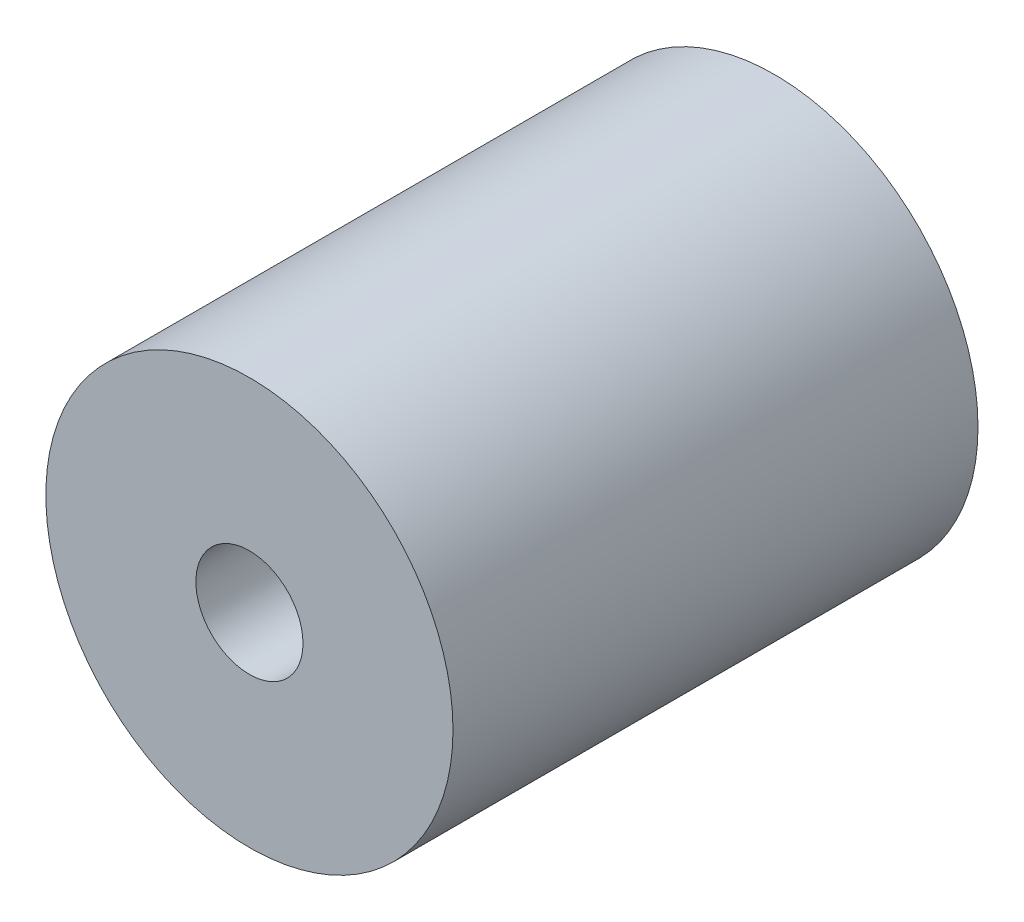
ISO-10303-21;
HEADER;
FILE_DESCRIPTION(('STEP AP214'),'2;1');
FILE_NAME('part.step','',(''),(''),'','','');
FILE_SCHEMA(('AUTOMOTIVE_DESIGN { 1 0 10303 214 1 1 1 1 }'));
ENDSEC;
DATA;
#1=APPLICATION_CONTEXT('core data for automotive mechanical design processes');
#2=APPLICATION_PROTOCOL_DEFINITION('international standard','automotive_design',2000,#1);
#3=PRODUCT_CONTEXT('',#1,'mechanical');
#4=PRODUCT('Part','Part','',(#3));
#5=PRODUCT_RELATED_PRODUCT_CATEGORY('part','',(#4));
#6=PRODUCT_DEFINITION_FORMATION('','',#4);
#7=PRODUCT_DEFINITION_CONTEXT('part definition',#1,'design');
#8=PRODUCT_DEFINITION('design','',#6,#7);
#9=PRODUCT_DEFINITION_SHAPE('','',#8);
#10=(LENGTH_UNIT() NAMED_UNIT(*) SI_UNIT(.MILLI.,.METRE.));
#11=(NAMED_UNIT(*) PLANE_ANGLE_UNIT() SI_UNIT($,.RADIAN.));
#12=(NAMED_UNIT(*) SI_UNIT($,.STERADIAN.) SOLID_ANGLE_UNIT());
#13=UNCERTAINTY_MEASURE_WITH_UNIT(LENGTH_MEASURE(1.E-05),#10,'distance_accuracy_value','');
#14=(GEOMETRIC_REPRESENTATION_CONTEXT(3) GLOBAL_UNCERTAINTY_ASSIGNED_CONTEXT((#13)) GLOBAL_UNIT_ASSIGNED_CONTEXT((#10,
#11,#12)) REPRESENTATION_CONTEXT('',''));
#15=CARTESIAN_POINT('',(0.,0.,0.));
#16=DIRECTION('',(0.,0.,1.));
#17=DIRECTION('',(1.,0.,0.));
#18=AXIS2_PLACEMENT_3D('',#15,#16,#17);
#19=CARTESIAN_POINT('',(0.,0.,24.5));
#20=DIRECTION('',(0.,0.,-1.));
#21=DIRECTION('',(-1.,0.,0.));
#22=AXIS2_PLACEMENT_3D('',#19,#20,#21);
#23=CYLINDRICAL_SURFACE('',#22,9.5);
#24=CARTESIAN_POINT('',(0.,0.,24.5));
#25=DIRECTION('',(0.,0.,1.));
#26=DIRECTION('',(1.,0.,0.));
#27=AXIS2_PLACEMENT_3D('',#24,#25,#26);
#28=CIRCLE('',#27,9.5);
#29=CARTESIAN_POINT('',(9.5,0.,24.5));
#30=VERTEX_POINT('',#29);
#31=EDGE_CURVE('E10',#30,#30,#28,.T.);
#32=ORIENTED_EDGE('',*,*,#31,.F.);
#33=EDGE_LOOP('',(#32));
#34=FACE_BOUND('',#33,.T.);
#35=CARTESIAN_POINT('',(0.,0.,0.));
#36=DIRECTION('',(0.,0.,1.));
#37=DIRECTION('',(1.,0.,0.));
#38=AXIS2_PLACEMENT_3D('',#35,#36,#37);
#39=CIRCLE('',#38,9.5);
#40=CARTESIAN_POINT('',(9.5,0.,0.));
#41=VERTEX_POINT('',#40);
#42=EDGE_CURVE('E34',#41,#41,#39,.T.);
#43=ORIENTED_EDGE('',*,*,#42,.T.);
#44=EDGE_LOOP('',(#43));
#45=FACE_BOUND('',#44,.T.);
#46=ADVANCED_FACE('F31',(#34,#45),#23,.T.);
#47=CARTESIAN_POINT('',(0.,0.,24.5));
#48=DIRECTION('',(0.,0.,1.));
#49=DIRECTION('',(1.,0.,0.));
#50=AXIS2_PLACEMENT_3D('',#47,#48,#49);
#51=PLANE('',#50);
#52=CARTESIAN_POINT('',(0.,0.,24.5));
#53=DIRECTION('',(0.,0.,1.));
#54=DIRECTION('',(1.,0.,0.));
#55=AXIS2_PLACEMENT_3D('',#52,#53,#54);
#56=CIRCLE('',#55,2.5);
#57=CARTESIAN_POINT('',(2.5,0.,24.5));
#58=VERTEX_POINT('',#57);
#59=EDGE_CURVE('E43',#58,#58,#56,.T.);
#60=ORIENTED_EDGE('',*,*,#59,.F.);
#61=EDGE_LOOP('',(#60));
#62=FACE_BOUND('',#61,.T.);
#63=ORIENTED_EDGE('',*,*,#31,.T.);
#64=EDGE_LOOP('',(#63));
#65=FACE_BOUND('',#64,.T.);
#66=ADVANCED_FACE('F68',(#62,#65),#51,.T.);
#67=CARTESIAN_POINT('',(0.,0.,0.));
#68=DIRECTION('',(0.,0.,1.));
#69=DIRECTION('',(1.,0.,0.));
#70=AXIS2_PLACEMENT_3D('',#67,#68,#69);
#71=PLANE('',#70);
#72=CARTESIAN_POINT('',(0.,0.,0.));
#73=DIRECTION('',(0.,0.,-1.));
#74=DIRECTION('',(-1.,0.,0.));
#75=AXIS2_PLACEMENT_3D('',#72,#73,#74);
#76=CIRCLE('',#75,2.5);
#77=CARTESIAN_POINT('',(-2.5,0.,0.));
#78=VERTEX_POINT('',#77);
#79=EDGE_CURVE('E49',#78,#78,#76,.T.);
#80=ORIENTED_EDGE('',*,*,#79,.F.);
#81=EDGE_LOOP('',(#80));
#82=FACE_BOUND('',#81,.T.);
#83=ORIENTED_EDGE('',*,*,#42,.F.);
#84=EDGE_LOOP('',(#83));
#85=FACE_BOUND('',#84,.T.);
#86=ADVANCED_FACE('F64',(#82,#85),#71,.F.);
#87=CARTESIAN_POINT('',(0.,0.,17.5));
#88=DIRECTION('',(0.,0.,1.));
#89=DIRECTION('',(1.,0.,0.));
#90=AXIS2_PLACEMENT_3D('',#87,#88,#89);
#91=CYLINDRICAL_SURFACE('',#90,2.5);
#92=CARTESIAN_POINT('',(0.,0.,17.5));
#93=DIRECTION('',(0.,0.,1.));
#94=DIRECTION('',(1.,0.,0.));
#95=AXIS2_PLACEMENT_3D('',#92,#93,#94);
#96=CIRCLE('',#95,2.5);
#97=CARTESIAN_POINT('',(2.5,0.,17.5));
#98=VERTEX_POINT('',#97);
#99=EDGE_CURVE('E41',#98,#98,#96,.T.);
#100=ORIENTED_EDGE('',*,*,#99,.F.);
#101=EDGE_LOOP('',(#100));
#102=FACE_BOUND('',#101,.T.);
#103=ORIENTED_EDGE('',*,*,#59,.T.);
#104=EDGE_LOOP('',(#103));
#105=FACE_BOUND('',#104,.T.);
#106=ADVANCED_FACE('F67',(#102,#105),#91,.F.);
#107=CARTESIAN_POINT('',(0.,0.,17.5));
#108=DIRECTION('',(0.,0.,1.));
#109=DIRECTION('',(1.,0.,0.));
#110=AXIS2_PLACEMENT_3D('',#107,#108,#109);
#111=PLANE('',#110);
#112=ORIENTED_EDGE('',*,*,#99,.T.);
#113=EDGE_LOOP('',(#112));
#114=FACE_BOUND('',#113,.T.);
#115=ADVANCED_FACE('F60',(#114),#111,.T.);
#116=CARTESIAN_POINT('',(0.,0.,7.));
#117=DIRECTION('',(0.,0.,-1.));
#118=DIRECTION('',(-1.,0.,0.));
#119=AXIS2_PLACEMENT_3D('',#116,#117,#118);
#120=CYLINDRICAL_SURFACE('',#119,2.5);
#121=CARTESIAN_POINT('',(0.,0.,7.));
#122=DIRECTION('',(0.,0.,-1.));
#123=DIRECTION('',(-1.,0.,0.));
#124=AXIS2_PLACEMENT_3D('',#121,#122,#123);
#125=CIRCLE('',#124,2.5);
#126=CARTESIAN_POINT('',(-2.5,0.,7.));
#127=VERTEX_POINT('',#126);
#128=EDGE_CURVE('E46',#127,#127,#125,.T.);
#129=ORIENTED_EDGE('',*,*,#128,.F.);
#130=EDGE_LOOP('',(#129));
#131=FACE_BOUND('',#130,.T.);
#132=ORIENTED_EDGE('',*,*,#79,.T.);
#133=EDGE_LOOP('',(#132));
#134=FACE_BOUND('',#133,.T.);
#135=ADVANCED_FACE('F57',(#131,#134),#120,.F.);
#136=CARTESIAN_POINT('',(0.,0.,7.));
#137=DIRECTION('',(0.,0.,-1.));
#138=DIRECTION('',(-1.,0.,0.));
#139=AXIS2_PLACEMENT_3D('',#136,#137,#138);
#140=PLANE('',#139);
#141=ORIENTED_EDGE('',*,*,#128,.T.);
#142=EDGE_LOOP('',(#141));
#143=FACE_BOUND('',#142,.T.);
#144=ADVANCED_FACE('F55',(#143),#140,.T.);
#145=CLOSED_SHELL('',(#46,#66,#86,#106,#115,#135,#144));
#146=MANIFOLD_SOLID_BREP('B2',#145);
#147=ADVANCED_BREP_SHAPE_REPRESENTATION('',(#18,#146),#14);
#148=SHAPE_DEFINITION_REPRESENTATION(#9,#147);
ENDSEC;
END-ISO-10303-21;
